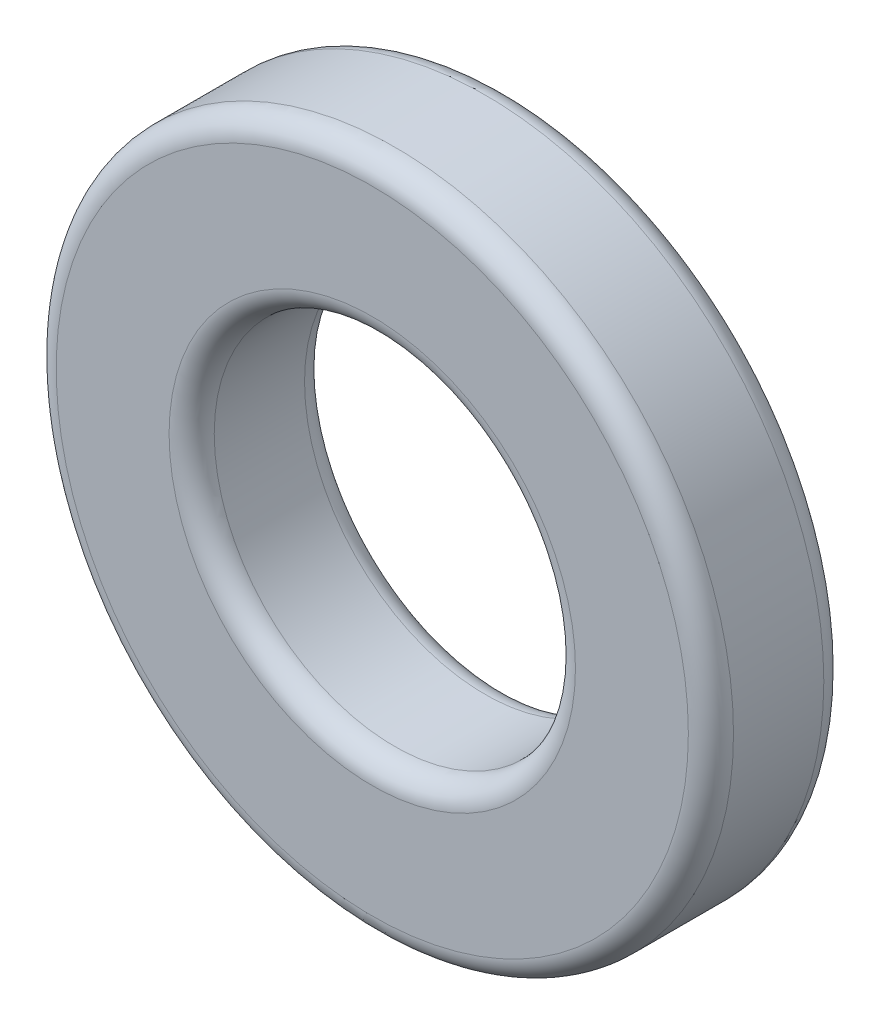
ISO-10303-21;
HEADER;
FILE_DESCRIPTION(('STEP AP214'),'2;1');
FILE_NAME('part.step','',(''),(''),'','','');
FILE_SCHEMA(('AUTOMOTIVE_DESIGN { 1 0 10303 214 1 1 1 1 }'));
ENDSEC;
DATA;
#1=APPLICATION_CONTEXT('core data for automotive mechanical design processes');
#2=APPLICATION_PROTOCOL_DEFINITION('international standard','automotive_design',2000,#1);
#3=PRODUCT_CONTEXT('',#1,'mechanical');
#4=PRODUCT('Part','Part','',(#3));
#5=PRODUCT_RELATED_PRODUCT_CATEGORY('part','',(#4));
#6=PRODUCT_DEFINITION_FORMATION('','',#4);
#7=PRODUCT_DEFINITION_CONTEXT('part definition',#1,'design');
#8=PRODUCT_DEFINITION('design','',#6,#7);
#9=PRODUCT_DEFINITION_SHAPE('','',#8);
#10=(LENGTH_UNIT() NAMED_UNIT(*) SI_UNIT(.MILLI.,.METRE.));
#11=(NAMED_UNIT(*) PLANE_ANGLE_UNIT() SI_UNIT($,.RADIAN.));
#12=(NAMED_UNIT(*) SI_UNIT($,.STERADIAN.) SOLID_ANGLE_UNIT());
#13=UNCERTAINTY_MEASURE_WITH_UNIT(LENGTH_MEASURE(1.E-05),#10,'distance_accuracy_value','');
#14=(GEOMETRIC_REPRESENTATION_CONTEXT(3) GLOBAL_UNCERTAINTY_ASSIGNED_CONTEXT((#13)) GLOBAL_UNIT_ASSIGNED_CONTEXT((#10,
#11,#12)) REPRESENTATION_CONTEXT('',''));
#15=CARTESIAN_POINT('',(0.,0.,0.));
#16=DIRECTION('',(0.,0.,1.));
#17=DIRECTION('',(1.,0.,0.));
#18=AXIS2_PLACEMENT_3D('',#15,#16,#17);
#19=CARTESIAN_POINT('',(0.,0.,3.));
#20=DIRECTION('',(0.,0.,1.));
#21=DIRECTION('',(1.,0.,0.));
#22=AXIS2_PLACEMENT_3D('',#19,#20,#21);
#23=PLANE('',#22);
#24=CARTESIAN_POINT('',(0.,0.,3.));
#25=DIRECTION('',(0.,0.,1.));
#26=DIRECTION('',(1.,0.,0.));
#27=AXIS2_PLACEMENT_3D('',#24,#25,#26);
#28=CIRCLE('',#27,4.5);
#29=CARTESIAN_POINT('',(4.5,0.,3.));
#30=VERTEX_POINT('',#29);
#31=EDGE_CURVE('E40',#30,#30,#28,.F.);
#32=ORIENTED_EDGE('',*,*,#31,.T.);
#33=EDGE_LOOP('',(#32));
#34=FACE_BOUND('',#33,.T.);
#35=CARTESIAN_POINT('',(0.,0.,3.));
#36=DIRECTION('',(0.,0.,1.));
#37=DIRECTION('',(1.,0.,0.));
#38=AXIS2_PLACEMENT_3D('',#35,#36,#37);
#39=CIRCLE('',#38,7.);
#40=CARTESIAN_POINT('',(7.,0.,3.));
#41=VERTEX_POINT('',#40);
#42=EDGE_CURVE('E44',#41,#41,#39,.T.);
#43=ORIENTED_EDGE('',*,*,#42,.T.);
#44=EDGE_LOOP('',(#43));
#45=FACE_BOUND('',#44,.T.);
#46=ADVANCED_FACE('F29',(#34,#45),#23,.T.);
#47=CARTESIAN_POINT('',(0.,0.,0.));
#48=DIRECTION('',(0.,0.,1.));
#49=DIRECTION('',(1.,0.,0.));
#50=AXIS2_PLACEMENT_3D('',#47,#48,#49);
#51=PLANE('',#50);
#52=CARTESIAN_POINT('',(0.,0.,0.));
#53=DIRECTION('',(0.,0.,1.));
#54=DIRECTION('',(1.,0.,0.));
#55=AXIS2_PLACEMENT_3D('',#52,#53,#54);
#56=CIRCLE('',#55,4.5);
#57=CARTESIAN_POINT('',(4.5,0.,0.));
#58=VERTEX_POINT('',#57);
#59=EDGE_CURVE('E55',#58,#58,#56,.T.);
#60=ORIENTED_EDGE('',*,*,#59,.T.);
#61=EDGE_LOOP('',(#60));
#62=FACE_BOUND('',#61,.T.);
#63=CARTESIAN_POINT('',(0.,0.,0.));
#64=DIRECTION('',(0.,0.,1.));
#65=DIRECTION('',(1.,0.,0.));
#66=AXIS2_PLACEMENT_3D('',#63,#64,#65);
#67=CIRCLE('',#66,7.);
#68=CARTESIAN_POINT('',(7.,0.,0.));
#69=VERTEX_POINT('',#68);
#70=EDGE_CURVE('E58',#69,#69,#67,.F.);
#71=ORIENTED_EDGE('',*,*,#70,.T.);
#72=EDGE_LOOP('',(#71));
#73=FACE_BOUND('',#72,.T.);
#74=ADVANCED_FACE('F62',(#62,#73),#51,.F.);
#75=CARTESIAN_POINT('',(0.,0.,3.));
#76=DIRECTION('',(0.,0.,-1.));
#77=DIRECTION('',(-1.,0.,0.));
#78=AXIS2_PLACEMENT_3D('',#75,#76,#77);
#79=CYLINDRICAL_SURFACE('',#78,7.5);
#80=CARTESIAN_POINT('',(0.,0.,0.5));
#81=DIRECTION('',(0.,0.,1.));
#82=DIRECTION('',(1.,0.,0.));
#83=AXIS2_PLACEMENT_3D('',#80,#81,#82);
#84=CIRCLE('',#83,7.5);
#85=CARTESIAN_POINT('',(7.5,0.,0.5));
#86=VERTEX_POINT('',#85);
#87=EDGE_CURVE('E10',#86,#86,#84,.T.);
#88=ORIENTED_EDGE('',*,*,#87,.T.);
#89=EDGE_LOOP('',(#88));
#90=FACE_BOUND('',#89,.T.);
#91=CARTESIAN_POINT('',(0.,0.,2.5));
#92=DIRECTION('',(0.,0.,1.));
#93=DIRECTION('',(1.,0.,0.));
#94=AXIS2_PLACEMENT_3D('',#91,#92,#93);
#95=CIRCLE('',#94,7.5);
#96=CARTESIAN_POINT('',(7.5,0.,2.5));
#97=VERTEX_POINT('',#96);
#98=EDGE_CURVE('E36',#97,#97,#95,.F.);
#99=ORIENTED_EDGE('',*,*,#98,.T.);
#100=EDGE_LOOP('',(#99));
#101=FACE_BOUND('',#100,.T.);
#102=ADVANCED_FACE('F82',(#90,#101),#79,.T.);
#103=CARTESIAN_POINT('',(0.,0.,3.));
#104=DIRECTION('',(0.,0.,-1.));
#105=DIRECTION('',(-1.,0.,0.));
#106=AXIS2_PLACEMENT_3D('',#103,#104,#105);
#107=CYLINDRICAL_SURFACE('',#106,4.);
#108=CARTESIAN_POINT('',(0.,0.,0.5));
#109=DIRECTION('',(0.,0.,1.));
#110=DIRECTION('',(1.,0.,0.));
#111=AXIS2_PLACEMENT_3D('',#108,#109,#110);
#112=CIRCLE('',#111,4.);
#113=CARTESIAN_POINT('',(4.,0.,0.5));
#114=VERTEX_POINT('',#113);
#115=EDGE_CURVE('E49',#114,#114,#112,.F.);
#116=ORIENTED_EDGE('',*,*,#115,.T.);
#117=EDGE_LOOP('',(#116));
#118=FACE_BOUND('',#117,.T.);
#119=CARTESIAN_POINT('',(0.,0.,2.5));
#120=DIRECTION('',(0.,0.,1.));
#121=DIRECTION('',(1.,0.,0.));
#122=AXIS2_PLACEMENT_3D('',#119,#120,#121);
#123=CIRCLE('',#122,4.);
#124=CARTESIAN_POINT('',(4.,0.,2.5));
#125=VERTEX_POINT('',#124);
#126=EDGE_CURVE('E52',#125,#125,#123,.T.);
#127=ORIENTED_EDGE('',*,*,#126,.T.);
#128=EDGE_LOOP('',(#127));
#129=FACE_BOUND('',#128,.T.);
#130=ADVANCED_FACE('F87',(#118,#129),#107,.F.);
#131=CARTESIAN_POINT('',(0.,0.,0.5));
#132=DIRECTION('',(0.,0.,1.));
#133=DIRECTION('',(1.,0.,0.));
#134=AXIS2_PLACEMENT_3D('',#131,#132,#133);
#135=TOROIDAL_SURFACE('',#134,4.5,0.5);
#136=ORIENTED_EDGE('',*,*,#115,.F.);
#137=EDGE_LOOP('',(#136));
#138=FACE_BOUND('',#137,.T.);
#139=ORIENTED_EDGE('',*,*,#59,.F.);
#140=EDGE_LOOP('',(#139));
#141=FACE_BOUND('',#140,.T.);
#142=ADVANCED_FACE('F73',(#138,#141),#135,.T.);
#143=CARTESIAN_POINT('',(0.,0.,2.5));
#144=DIRECTION('',(0.,0.,1.));
#145=DIRECTION('',(1.,0.,0.));
#146=AXIS2_PLACEMENT_3D('',#143,#144,#145);
#147=TOROIDAL_SURFACE('',#146,4.5,0.5);
#148=ORIENTED_EDGE('',*,*,#31,.F.);
#149=EDGE_LOOP('',(#148));
#150=FACE_BOUND('',#149,.T.);
#151=ORIENTED_EDGE('',*,*,#126,.F.);
#152=EDGE_LOOP('',(#151));
#153=FACE_BOUND('',#152,.T.);
#154=ADVANCED_FACE('F67',(#150,#153),#147,.T.);
#155=CARTESIAN_POINT('',(0.,0.,0.5));
#156=DIRECTION('',(0.,0.,1.));
#157=DIRECTION('',(1.,0.,0.));
#158=AXIS2_PLACEMENT_3D('',#155,#156,#157);
#159=TOROIDAL_SURFACE('',#158,7.,0.5);
#160=ORIENTED_EDGE('',*,*,#70,.F.);
#161=EDGE_LOOP('',(#160));
#162=FACE_BOUND('',#161,.T.);
#163=ORIENTED_EDGE('',*,*,#87,.F.);
#164=EDGE_LOOP('',(#163));
#165=FACE_BOUND('',#164,.T.);
#166=ADVANCED_FACE('F64',(#162,#165),#159,.T.);
#167=CARTESIAN_POINT('',(0.,0.,2.5));
#168=DIRECTION('',(0.,0.,1.));
#169=DIRECTION('',(1.,0.,0.));
#170=AXIS2_PLACEMENT_3D('',#167,#168,#169);
#171=TOROIDAL_SURFACE('',#170,7.,0.5);
#172=ORIENTED_EDGE('',*,*,#98,.F.);
#173=EDGE_LOOP('',(#172));
#174=FACE_BOUND('',#173,.T.);
#175=ORIENTED_EDGE('',*,*,#42,.F.);
#176=EDGE_LOOP('',(#175));
#177=FACE_BOUND('',#176,.T.);
#178=ADVANCED_FACE('F31',(#174,#177),#171,.T.);
#179=CLOSED_SHELL('',(#46,#74,#102,#130,#142,#154,#166,#178));
#180=MANIFOLD_SOLID_BREP('B2',#179);
#181=ADVANCED_BREP_SHAPE_REPRESENTATION('',(#18,#180),#14);
#182=SHAPE_DEFINITION_REPRESENTATION(#9,#181);
ENDSEC;
END-ISO-10303-21;
